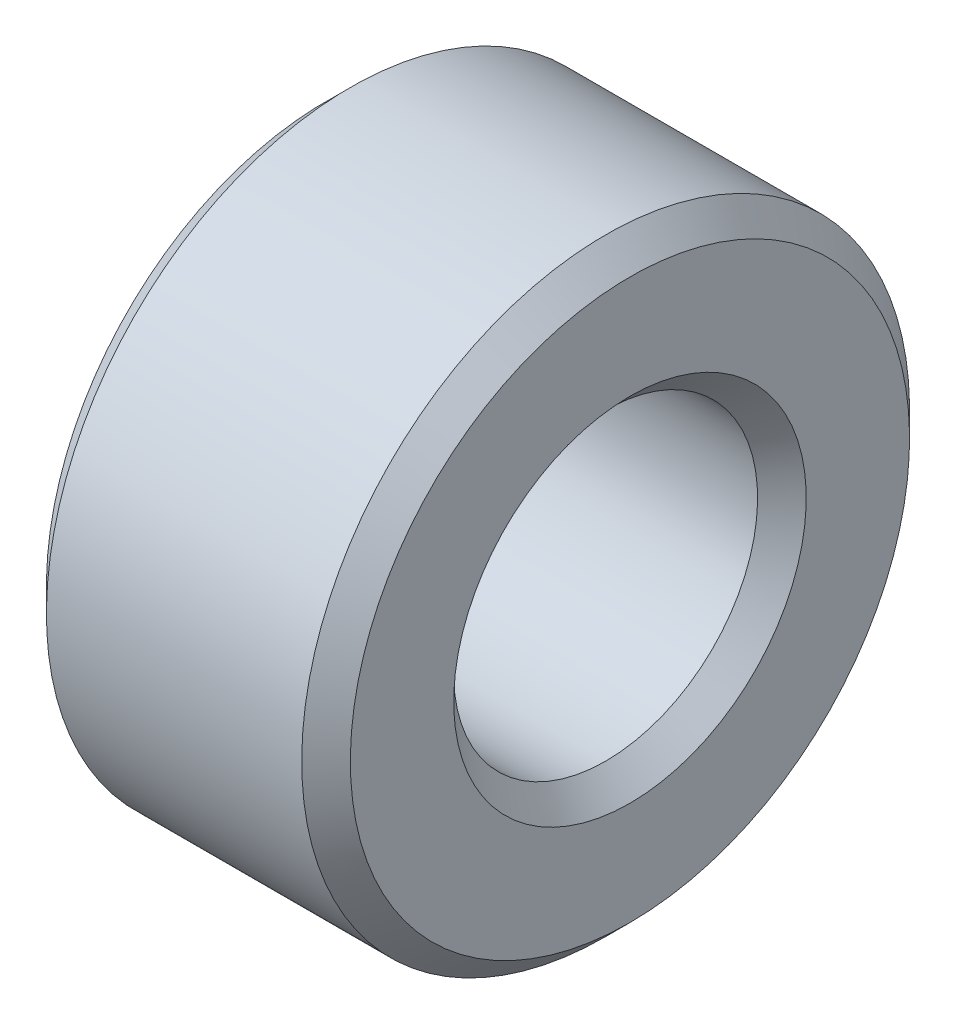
ISO-10303-21;
HEADER;
FILE_DESCRIPTION(('STEP AP214'),'2;1');
FILE_NAME('part.step','',(''),(''),'','','');
FILE_SCHEMA(('AUTOMOTIVE_DESIGN { 1 0 10303 214 1 1 1 1 }'));
ENDSEC;
DATA;
#1=APPLICATION_CONTEXT('core data for automotive mechanical design processes');
#2=APPLICATION_PROTOCOL_DEFINITION('international standard','automotive_design',2000,#1);
#3=PRODUCT_CONTEXT('',#1,'mechanical');
#4=PRODUCT('Part','Part','',(#3));
#5=PRODUCT_RELATED_PRODUCT_CATEGORY('part','',(#4));
#6=PRODUCT_DEFINITION_FORMATION('','',#4);
#7=PRODUCT_DEFINITION_CONTEXT('part definition',#1,'design');
#8=PRODUCT_DEFINITION('design','',#6,#7);
#9=PRODUCT_DEFINITION_SHAPE('','',#8);
#10=(LENGTH_UNIT() NAMED_UNIT(*) SI_UNIT(.MILLI.,.METRE.));
#11=(NAMED_UNIT(*) PLANE_ANGLE_UNIT() SI_UNIT($,.RADIAN.));
#12=(NAMED_UNIT(*) SI_UNIT($,.STERADIAN.) SOLID_ANGLE_UNIT());
#13=UNCERTAINTY_MEASURE_WITH_UNIT(LENGTH_MEASURE(1.E-05),#10,'distance_accuracy_value','');
#14=(GEOMETRIC_REPRESENTATION_CONTEXT(3) GLOBAL_UNCERTAINTY_ASSIGNED_CONTEXT((#13)) GLOBAL_UNIT_ASSIGNED_CONTEXT((#10,
#11,#12)) REPRESENTATION_CONTEXT('',''));
#15=CARTESIAN_POINT('',(0.,0.,0.));
#16=DIRECTION('',(0.,0.,1.));
#17=DIRECTION('',(1.,0.,0.));
#18=AXIS2_PLACEMENT_3D('',#15,#16,#17);
#19=CARTESIAN_POINT('',(0.,-3.75,0.));
#20=DIRECTION('',(-1.,0.,0.));
#21=DIRECTION('',(0.,1.,0.));
#22=AXIS2_PLACEMENT_3D('',#19,#20,#21);
#23=PLANE('',#22);
#24=CARTESIAN_POINT('',(0.,0.,0.));
#25=DIRECTION('',(1.,0.,0.));
#26=DIRECTION('',(0.,-1.,0.));
#27=AXIS2_PLACEMENT_3D('',#24,#25,#26);
#28=CIRCLE('',#27,2.9);
#29=CARTESIAN_POINT('',(0.,-2.9,0.));
#30=VERTEX_POINT('',#29);
#31=EDGE_CURVE('E9',#30,#30,#28,.T.);
#32=ORIENTED_EDGE('',*,*,#31,.T.);
#33=EDGE_LOOP('',(#32));
#34=FACE_BOUND('',#33,.T.);
#35=CARTESIAN_POINT('',(0.,0.,0.));
#36=DIRECTION('',(1.,0.,0.));
#37=DIRECTION('',(0.,-1.,0.));
#38=AXIS2_PLACEMENT_3D('',#35,#36,#37);
#39=CIRCLE('',#38,4.6);
#40=CARTESIAN_POINT('',(0.,-4.6,0.));
#41=VERTEX_POINT('',#40);
#42=EDGE_CURVE('E53',#41,#41,#39,.T.);
#43=ORIENTED_EDGE('',*,*,#42,.F.);
#44=EDGE_LOOP('',(#43));
#45=FACE_BOUND('',#44,.T.);
#46=ADVANCED_FACE('F15',(#34,#45),#23,.T.);
#47=CARTESIAN_POINT('',(0.2,0.,0.));
#48=DIRECTION('',(-1.,0.,0.));
#49=DIRECTION('',(0.,-1.,0.));
#50=AXIS2_PLACEMENT_3D('',#47,#48,#49);
#51=CONICAL_SURFACE('',#50,2.7,0.785398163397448);
#52=CARTESIAN_POINT('',(0.4,0.,0.));
#53=DIRECTION('',(1.,0.,0.));
#54=DIRECTION('',(0.,-1.,0.));
#55=AXIS2_PLACEMENT_3D('',#52,#53,#54);
#56=CIRCLE('',#55,2.5);
#57=CARTESIAN_POINT('',(0.4,-2.5,0.));
#58=VERTEX_POINT('',#57);
#59=EDGE_CURVE('E22',#58,#58,#56,.T.);
#60=ORIENTED_EDGE('',*,*,#59,.T.);
#61=EDGE_LOOP('',(#60));
#62=FACE_BOUND('',#61,.T.);
#63=ORIENTED_EDGE('',*,*,#31,.F.);
#64=EDGE_LOOP('',(#63));
#65=FACE_BOUND('',#64,.T.);
#66=ADVANCED_FACE('F82',(#62,#65),#51,.F.);
#67=CARTESIAN_POINT('',(2.5,0.,0.));
#68=DIRECTION('',(-1.,0.,0.));
#69=DIRECTION('',(0.,-1.,0.));
#70=AXIS2_PLACEMENT_3D('',#67,#68,#69);
#71=CYLINDRICAL_SURFACE('',#70,2.5);
#72=CARTESIAN_POINT('',(4.6,0.,0.));
#73=DIRECTION('',(1.,0.,0.));
#74=DIRECTION('',(0.,-1.,0.));
#75=AXIS2_PLACEMENT_3D('',#72,#73,#74);
#76=CIRCLE('',#75,2.5);
#77=CARTESIAN_POINT('',(4.6,-2.5,0.));
#78=VERTEX_POINT('',#77);
#79=EDGE_CURVE('E58',#78,#78,#76,.T.);
#80=ORIENTED_EDGE('',*,*,#79,.T.);
#81=EDGE_LOOP('',(#80));
#82=FACE_BOUND('',#81,.T.);
#83=ORIENTED_EDGE('',*,*,#59,.F.);
#84=EDGE_LOOP('',(#83));
#85=FACE_BOUND('',#84,.T.);
#86=ADVANCED_FACE('F66',(#82,#85),#71,.F.);
#87=CARTESIAN_POINT('',(4.8,0.,0.));
#88=DIRECTION('',(1.,0.,0.));
#89=DIRECTION('',(0.,-1.,0.));
#90=AXIS2_PLACEMENT_3D('',#87,#88,#89);
#91=CONICAL_SURFACE('',#90,2.7,0.785398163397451);
#92=CARTESIAN_POINT('',(5.,0.,0.));
#93=DIRECTION('',(1.,0.,0.));
#94=DIRECTION('',(0.,-1.,0.));
#95=AXIS2_PLACEMENT_3D('',#92,#93,#94);
#96=CIRCLE('',#95,2.9);
#97=CARTESIAN_POINT('',(5.,-2.9,0.));
#98=VERTEX_POINT('',#97);
#99=EDGE_CURVE('E63',#98,#98,#96,.T.);
#100=ORIENTED_EDGE('',*,*,#99,.T.);
#101=EDGE_LOOP('',(#100));
#102=FACE_BOUND('',#101,.T.);
#103=ORIENTED_EDGE('',*,*,#79,.F.);
#104=EDGE_LOOP('',(#103));
#105=FACE_BOUND('',#104,.T.);
#106=ADVANCED_FACE('F69',(#102,#105),#91,.F.);
#107=CARTESIAN_POINT('',(5.,-3.75,0.));
#108=DIRECTION('',(1.,0.,0.));
#109=DIRECTION('',(0.,-1.,0.));
#110=AXIS2_PLACEMENT_3D('',#107,#108,#109);
#111=PLANE('',#110);
#112=CARTESIAN_POINT('',(5.,0.,0.));
#113=DIRECTION('',(1.,0.,0.));
#114=DIRECTION('',(0.,-1.,0.));
#115=AXIS2_PLACEMENT_3D('',#112,#113,#114);
#116=CIRCLE('',#115,4.6);
#117=CARTESIAN_POINT('',(5.,-4.6,0.));
#118=VERTEX_POINT('',#117);
#119=EDGE_CURVE('E61',#118,#118,#116,.T.);
#120=ORIENTED_EDGE('',*,*,#119,.T.);
#121=EDGE_LOOP('',(#120));
#122=FACE_BOUND('',#121,.T.);
#123=ORIENTED_EDGE('',*,*,#99,.F.);
#124=EDGE_LOOP('',(#123));
#125=FACE_BOUND('',#124,.T.);
#126=ADVANCED_FACE('F71',(#122,#125),#111,.T.);
#127=CARTESIAN_POINT('',(4.8,0.,0.));
#128=DIRECTION('',(-1.,0.,0.));
#129=DIRECTION('',(0.,-1.,0.));
#130=AXIS2_PLACEMENT_3D('',#127,#128,#129);
#131=CONICAL_SURFACE('',#130,4.8,0.785398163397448);
#132=CARTESIAN_POINT('',(4.6,0.,0.));
#133=DIRECTION('',(1.,0.,0.));
#134=DIRECTION('',(0.,-1.,0.));
#135=AXIS2_PLACEMENT_3D('',#132,#133,#134);
#136=CIRCLE('',#135,5.);
#137=CARTESIAN_POINT('',(4.6,-5.,0.));
#138=VERTEX_POINT('',#137);
#139=EDGE_CURVE('E55',#138,#138,#136,.T.);
#140=ORIENTED_EDGE('',*,*,#139,.T.);
#141=EDGE_LOOP('',(#140));
#142=FACE_BOUND('',#141,.T.);
#143=ORIENTED_EDGE('',*,*,#119,.F.);
#144=EDGE_LOOP('',(#143));
#145=FACE_BOUND('',#144,.T.);
#146=ADVANCED_FACE('F79',(#142,#145),#131,.T.);
#147=CARTESIAN_POINT('',(2.5,0.,0.));
#148=DIRECTION('',(-1.,0.,0.));
#149=DIRECTION('',(0.,-1.,0.));
#150=AXIS2_PLACEMENT_3D('',#147,#148,#149);
#151=CYLINDRICAL_SURFACE('',#150,5.);
#152=CARTESIAN_POINT('',(0.4,0.,0.));
#153=DIRECTION('',(1.,0.,0.));
#154=DIRECTION('',(0.,-1.,0.));
#155=AXIS2_PLACEMENT_3D('',#152,#153,#154);
#156=CIRCLE('',#155,5.);
#157=CARTESIAN_POINT('',(0.4,-5.,0.));
#158=VERTEX_POINT('',#157);
#159=EDGE_CURVE('E49',#158,#158,#156,.T.);
#160=ORIENTED_EDGE('',*,*,#159,.T.);
#161=EDGE_LOOP('',(#160));
#162=FACE_BOUND('',#161,.T.);
#163=ORIENTED_EDGE('',*,*,#139,.F.);
#164=EDGE_LOOP('',(#163));
#165=FACE_BOUND('',#164,.T.);
#166=ADVANCED_FACE('F50',(#162,#165),#151,.T.);
#167=CARTESIAN_POINT('',(0.2,0.,0.));
#168=DIRECTION('',(1.,0.,0.));
#169=DIRECTION('',(0.,-1.,0.));
#170=AXIS2_PLACEMENT_3D('',#167,#168,#169);
#171=CONICAL_SURFACE('',#170,4.8,0.785398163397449);
#172=ORIENTED_EDGE('',*,*,#42,.T.);
#173=EDGE_LOOP('',(#172));
#174=FACE_BOUND('',#173,.T.);
#175=ORIENTED_EDGE('',*,*,#159,.F.);
#176=EDGE_LOOP('',(#175));
#177=FACE_BOUND('',#176,.T.);
#178=ADVANCED_FACE('F92',(#174,#177),#171,.T.);
#179=CLOSED_SHELL('',(#46,#66,#86,#106,#126,#146,#166,#178));
#180=MANIFOLD_SOLID_BREP('B1',#179);
#181=ADVANCED_BREP_SHAPE_REPRESENTATION('',(#18,#180),#14);
#182=SHAPE_DEFINITION_REPRESENTATION(#9,#181);
ENDSEC;
END-ISO-10303-21;
